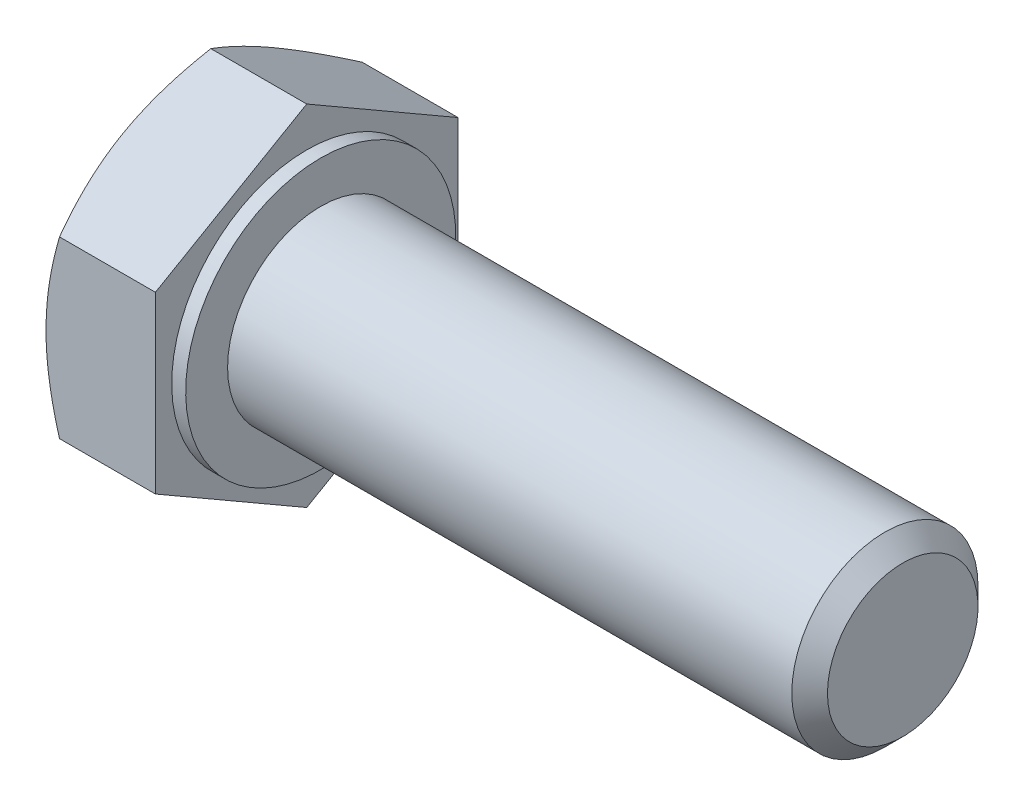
ISO-10303-21;
HEADER;
FILE_DESCRIPTION(('STEP AP214'),'2;1');
FILE_NAME('part.step','',(''),(''),'','','');
FILE_SCHEMA(('AUTOMOTIVE_DESIGN { 1 0 10303 214 1 1 1 1 }'));
ENDSEC;
DATA;
#1=APPLICATION_CONTEXT('core data for automotive mechanical design processes');
#2=APPLICATION_PROTOCOL_DEFINITION('international standard','automotive_design',2000,#1);
#3=PRODUCT_CONTEXT('',#1,'mechanical');
#4=PRODUCT('Part','Part','',(#3));
#5=PRODUCT_RELATED_PRODUCT_CATEGORY('part','',(#4));
#6=PRODUCT_DEFINITION_FORMATION('','',#4);
#7=PRODUCT_DEFINITION_CONTEXT('part definition',#1,'design');
#8=PRODUCT_DEFINITION('design','',#6,#7);
#9=PRODUCT_DEFINITION_SHAPE('','',#8);
#10=(LENGTH_UNIT() NAMED_UNIT(*) SI_UNIT(.MILLI.,.METRE.));
#11=(NAMED_UNIT(*) PLANE_ANGLE_UNIT() SI_UNIT($,.RADIAN.));
#12=(NAMED_UNIT(*) SI_UNIT($,.STERADIAN.) SOLID_ANGLE_UNIT());
#13=UNCERTAINTY_MEASURE_WITH_UNIT(LENGTH_MEASURE(1.E-05),#10,'distance_accuracy_value','');
#14=(GEOMETRIC_REPRESENTATION_CONTEXT(3) GLOBAL_UNCERTAINTY_ASSIGNED_CONTEXT((#13)) GLOBAL_UNIT_ASSIGNED_CONTEXT((#10,
#11,#12)) REPRESENTATION_CONTEXT('',''));
#15=CARTESIAN_POINT('',(0.,0.,0.));
#16=DIRECTION('',(0.,0.,1.));
#17=DIRECTION('',(1.,0.,0.));
#18=AXIS2_PLACEMENT_3D('',#15,#16,#17);
#19=CARTESIAN_POINT('',(-5.30009999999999,0.,0.));
#20=DIRECTION('',(1.,0.,0.));
#21=DIRECTION('',(0.,0.,-1.));
#22=AXIS2_PLACEMENT_3D('',#19,#20,#21);
#23=PLANE('',#22);
#24=CARTESIAN_POINT('',(-5.30010000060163,0.,0.));
#25=DIRECTION('',(1.,0.,0.));
#26=DIRECTION('',(0.,0.,-1.));
#27=AXIS2_PLACEMENT_3D('',#24,#25,#26);
#28=CIRCLE('',#27,6.50000000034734);
#29=CARTESIAN_POINT('',(-5.3001000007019,5.62916512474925,-3.25000000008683));
#30=VERTEX_POINT('',#29);
#31=CARTESIAN_POINT('',(-5.3001000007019,5.62916512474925,3.25000000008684));
#32=VERTEX_POINT('',#31);
#33=EDGE_CURVE('E322',#30,#32,#28,.T.);
#34=ORIENTED_EDGE('',*,*,#33,.F.);
#35=CARTESIAN_POINT('',(-5.30010000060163,0.,0.));
#36=DIRECTION('',(1.,0.,0.));
#37=DIRECTION('',(0.,0.,-1.));
#38=AXIS2_PLACEMENT_3D('',#35,#36,#37);
#39=CIRCLE('',#38,6.50000000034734);
#40=CARTESIAN_POINT('',(-5.3001000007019,0.,-6.50000000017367));
#41=VERTEX_POINT('',#40);
#42=EDGE_CURVE('E318',#41,#30,#39,.T.);
#43=ORIENTED_EDGE('',*,*,#42,.F.);
#44=CARTESIAN_POINT('',(-5.30010000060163,0.,0.));
#45=DIRECTION('',(1.,0.,0.));
#46=DIRECTION('',(0.,0.,-1.));
#47=AXIS2_PLACEMENT_3D('',#44,#45,#46);
#48=CIRCLE('',#47,6.50000000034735);
#49=CARTESIAN_POINT('',(-5.3001000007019,-5.62916512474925,-3.25000000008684));
#50=VERTEX_POINT('',#49);
#51=EDGE_CURVE('E314',#50,#41,#48,.T.);
#52=ORIENTED_EDGE('',*,*,#51,.F.);
#53=CARTESIAN_POINT('',(-5.30010000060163,0.,0.));
#54=DIRECTION('',(1.,0.,0.));
#55=DIRECTION('',(0.,0.,-1.));
#56=AXIS2_PLACEMENT_3D('',#53,#54,#55);
#57=CIRCLE('',#56,6.50000000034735);
#58=CARTESIAN_POINT('',(-5.3001000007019,-5.62916512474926,3.25000000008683));
#59=VERTEX_POINT('',#58);
#60=EDGE_CURVE('E89',#59,#50,#57,.T.);
#61=ORIENTED_EDGE('',*,*,#60,.F.);
#62=CARTESIAN_POINT('',(-5.30010000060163,0.,0.));
#63=DIRECTION('',(1.,0.,0.));
#64=DIRECTION('',(0.,0.,-1.));
#65=AXIS2_PLACEMENT_3D('',#62,#63,#64);
#66=CIRCLE('',#65,6.50000000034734);
#67=CARTESIAN_POINT('',(-5.3001000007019,0.,6.50000000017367));
#68=VERTEX_POINT('',#67);
#69=EDGE_CURVE('E86',#68,#59,#66,.T.);
#70=ORIENTED_EDGE('',*,*,#69,.F.);
#71=CARTESIAN_POINT('',(-5.30010000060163,0.,0.));
#72=DIRECTION('',(1.,0.,0.));
#73=DIRECTION('',(0.,0.,-1.));
#74=AXIS2_PLACEMENT_3D('',#71,#72,#73);
#75=CIRCLE('',#74,6.50000000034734);
#76=EDGE_CURVE('E18',#32,#68,#75,.T.);
#77=ORIENTED_EDGE('',*,*,#76,.F.);
#78=EDGE_LOOP('',(#34,#43,#52,#61,#70,#77));
#79=FACE_BOUND('',#78,.T.);
#80=ADVANCED_FACE('F15',(#79),#23,.F.);
#81=CARTESIAN_POINT('',(-4.71606007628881,0.,0.));
#82=DIRECTION('',(1.,0.,0.));
#83=DIRECTION('',(0.,0.,-1.));
#84=AXIS2_PLACEMENT_3D('',#81,#82,#83);
#85=CONICAL_SURFACE('',#84,7.51158682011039,1.04719755);
#86=ORIENTED_EDGE('',*,*,#76,.T.);
#87=CARTESIAN_POINT('',(-4.71954341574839,3.75277674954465,6.50000000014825));
#88=CARTESIAN_POINT('',(-4.80774841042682,3.44730232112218,6.50000000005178));
#89=CARTESIAN_POINT('',(-4.88855958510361,3.13938154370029,6.50000000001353));
#90=CARTESIAN_POINT('',(-5.03106863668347,2.52082569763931,6.49999999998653));
#91=CARTESIAN_POINT('',(-5.09286102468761,2.2102122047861,6.49999999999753));
#92=CARTESIAN_POINT('',(-5.16873158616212,1.74136052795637,6.50000000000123));
#93=CARTESIAN_POINT('',(-5.19122798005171,1.58448437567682,6.50000000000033));
#94=CARTESIAN_POINT('',(-5.23016970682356,1.26998104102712,6.49999999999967));
#95=CARTESIAN_POINT('',(-5.24661519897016,1.11235387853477,6.4999999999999));
#96=CARTESIAN_POINT('',(-5.27316617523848,0.795765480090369,6.50000000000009));
#97=CARTESIAN_POINT('',(-5.28323941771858,0.636801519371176,6.50000000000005));
#98=CARTESIAN_POINT('',(-5.29672027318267,0.31856096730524,6.49999999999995));
#99=CARTESIAN_POINT('',(-5.30012656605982,0.159284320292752,6.4999999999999));
#100=CARTESIAN_POINT('',(-5.30010000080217,1.44683826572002E-11,6.5));
#101=B_SPLINE_CURVE_WITH_KNOTS('',3,(#87,#88,#89,#90,#91,#92,#93,#94,#95,#96,#97,#98,#99,#100),
.UNSPECIFIED.,.F.,.F.,(4,2,2,2,2,2,4),(0.,0.95424765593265,1.90367376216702,2.37900973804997,
2.85433320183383,3.33204281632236,3.80984701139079),.UNSPECIFIED.);
#102=CARTESIAN_POINT('',(-4.71954341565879,3.75277674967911,6.49999999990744));
#103=VERTEX_POINT('',#102);
#104=EDGE_CURVE('E107',#103,#68,#101,.T.);
#105=ORIENTED_EDGE('',*,*,#104,.F.);
#106=CARTESIAN_POINT('',(-5.30010000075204,5.62916512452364,3.24999999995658));
#107=CARTESIAN_POINT('',(-5.30012656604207,5.54952296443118,3.38794426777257));
#108=CARTESIAN_POINT('',(-5.29672027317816,5.4698846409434,3.52588189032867));
#109=CARTESIAN_POINT('',(-5.28323941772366,5.31076436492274,3.80148629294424));
#110=CARTESIAN_POINT('',(-5.27316617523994,5.231282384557,3.93915312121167));
#111=CARTESIAN_POINT('',(-5.24661519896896,5.07298818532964,4.21332671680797));
#112=CARTESIAN_POINT('',(-5.23016970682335,4.99417460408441,4.34983584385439));
#113=CARTESIAN_POINT('',(-5.19122798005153,4.8369229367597,4.62220372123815));
#114=CARTESIAN_POINT('',(-5.16873158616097,4.75848486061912,4.75806245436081));
#115=CARTESIAN_POINT('',(-5.09286102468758,4.52405902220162,5.16409991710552));
#116=CARTESIAN_POINT('',(-5.03106863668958,4.36875227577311,5.43309909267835));
#117=CARTESIAN_POINT('',(-4.88855958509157,4.059474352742,5.96878416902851));
#118=CARTESIAN_POINT('',(-4.80774841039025,3.90551396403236,6.23545138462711));
#119=CARTESIAN_POINT('',(-4.71954341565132,3.7527767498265,6.49999999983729));
#120=B_SPLINE_CURVE_WITH_KNOTS('',3,(#106,#107,#108,#109,#110,#111,#112,#113,#114,#115,#116,
#117,#118,#119),.UNSPECIFIED.,.F.,.F.,(4,2,2,2,2,2,4),(0.,0.477804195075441,0.955513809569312,
1.43083727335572,1.90617324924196,2.85559935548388,3.80984701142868),.UNSPECIFIED.);
#121=EDGE_CURVE('E101',#32,#103,#120,.T.);
#122=ORIENTED_EDGE('',*,*,#121,.F.);
#123=EDGE_LOOP('',(#86,#105,#122));
#124=FACE_BOUND('',#123,.T.);
#125=ADVANCED_FACE('F106',(#124),#85,.T.);
#126=CARTESIAN_POINT('',(-4.71606007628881,0.,0.));
#127=DIRECTION('',(1.,0.,0.));
#128=DIRECTION('',(0.,0.,-1.));
#129=AXIS2_PLACEMENT_3D('',#126,#127,#128);
#130=CONICAL_SURFACE('',#129,7.51158682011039,1.04719755);
#131=CARTESIAN_POINT('',(-5.30010000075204,0.,6.49999999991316));
#132=CARTESIAN_POINT('',(-5.30012656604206,-0.159284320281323,6.49999999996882));
#133=CARTESIAN_POINT('',(-5.29672027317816,-0.318560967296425,6.49999999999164));
#134=CARTESIAN_POINT('',(-5.28323941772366,-0.636801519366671,6.50000000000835));
#135=CARTESIAN_POINT('',(-5.27316617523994,-0.795765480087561,6.50000000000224));
#136=CARTESIAN_POINT('',(-5.24661519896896,-1.11235387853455,6.49999999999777));
#137=CARTESIAN_POINT('',(-5.23016970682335,-1.26998104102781,6.49999999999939));
#138=CARTESIAN_POINT('',(-5.19122798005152,-1.58448437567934,6.50000000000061));
#139=CARTESIAN_POINT('',(-5.16873158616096,-1.74136052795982,6.50000000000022));
#140=CARTESIAN_POINT('',(-5.09286102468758,-2.21021220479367,6.49999999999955));
#141=CARTESIAN_POINT('',(-5.03106863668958,-2.52082569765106,6.49999999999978));
#142=CARTESIAN_POINT('',(-4.88855958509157,-3.13938154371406,6.50000000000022));
#143=CARTESIAN_POINT('',(-4.80774841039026,-3.44730232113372,6.50000000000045));
#144=CARTESIAN_POINT('',(-4.71954341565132,-3.75277674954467,6.5));
#145=B_SPLINE_CURVE_WITH_KNOTS('',3,(#131,#132,#133,#134,#135,#136,#137,#138,#139,#140,#141,
#142,#143,#144),.UNSPECIFIED.,.F.,.F.,(4,2,2,2,2,2,4),(0.,0.477804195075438,0.955513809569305,
1.43083727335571,1.90617324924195,2.85559935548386,3.80984701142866),.UNSPECIFIED.);
#146=CARTESIAN_POINT('',(-4.71954341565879,-3.75277674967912,6.49999999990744));
#147=VERTEX_POINT('',#146);
#148=EDGE_CURVE('E94',#68,#147,#145,.T.);
#149=ORIENTED_EDGE('',*,*,#148,.F.);
#150=ORIENTED_EDGE('',*,*,#69,.T.);
#151=CARTESIAN_POINT('',(-4.71954341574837,-3.75277674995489,6.49999999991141));
#152=CARTESIAN_POINT('',(-4.80774841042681,-3.90551396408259,6.23545138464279));
#153=CARTESIAN_POINT('',(-4.8885595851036,-4.05947435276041,5.96878416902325));
#154=CARTESIAN_POINT('',(-5.03106863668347,-4.36875227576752,5.43309909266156));
#155=CARTESIAN_POINT('',(-5.09286102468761,-4.52405902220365,5.16409991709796));
#156=CARTESIAN_POINT('',(-5.16873158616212,-4.75848486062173,4.75806245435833));
#157=CARTESIAN_POINT('',(-5.19122798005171,-4.83692293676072,4.62220372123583));
#158=CARTESIAN_POINT('',(-5.23016970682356,-4.99417460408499,4.34983584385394));
#159=CARTESIAN_POINT('',(-5.24661519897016,-5.07298818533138,4.21332671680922));
#160=CARTESIAN_POINT('',(-5.27316617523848,-5.23128238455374,3.93915312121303));
#161=CARTESIAN_POINT('',(-5.28323941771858,-5.3107643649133,3.80148629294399));
#162=CARTESIAN_POINT('',(-5.29672027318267,-5.46988464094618,3.52588189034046));
#163=CARTESIAN_POINT('',(-5.30012656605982,-5.54952296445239,3.38794426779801));
#164=CARTESIAN_POINT('',(-5.30010000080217,-5.62916512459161,3.25000000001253));
#165=B_SPLINE_CURVE_WITH_KNOTS('',3,(#151,#152,#153,#154,#155,#156,#157,#158,#159,#160,#161,
#162,#163,#164),.UNSPECIFIED.,.F.,.F.,(4,2,2,2,2,2,4),(0.,0.954247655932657,1.90367376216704,
2.37900973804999,2.85433320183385,3.33204281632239,3.80984701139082),.UNSPECIFIED.);
#166=EDGE_CURVE('E96',#147,#59,#165,.T.);
#167=ORIENTED_EDGE('',*,*,#166,.F.);
#168=EDGE_LOOP('',(#149,#150,#167));
#169=FACE_BOUND('',#168,.T.);
#170=ADVANCED_FACE('F95',(#169),#130,.T.);
#171=CARTESIAN_POINT('',(-4.71606007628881,0.,0.));
#172=DIRECTION('',(1.,0.,0.));
#173=DIRECTION('',(0.,0.,-1.));
#174=AXIS2_PLACEMENT_3D('',#171,#172,#173);
#175=CONICAL_SURFACE('',#174,7.51158682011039,1.04719755);
#176=CARTESIAN_POINT('',(-5.30010000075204,-5.62916512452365,3.24999999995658));
#177=CARTESIAN_POINT('',(-5.30012656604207,-5.7088072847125,3.11205573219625));
#178=CARTESIAN_POINT('',(-5.29672027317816,-5.78844560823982,2.97411810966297));
#179=CARTESIAN_POINT('',(-5.28323941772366,-5.94756588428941,2.69851370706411));
#180=CARTESIAN_POINT('',(-5.27316617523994,-6.02704786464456,2.56084687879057));
#181=CARTESIAN_POINT('',(-5.24661519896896,-6.18534206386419,2.28667328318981));
#182=CARTESIAN_POINT('',(-5.23016970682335,-6.26415564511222,2.150164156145));
#183=CARTESIAN_POINT('',(-5.19122798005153,-6.42140731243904,1.87779627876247));
#184=CARTESIAN_POINT('',(-5.16873158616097,-6.49984538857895,1.74193754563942));
#185=CARTESIAN_POINT('',(-5.09286102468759,-6.7342712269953,1.33590008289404));
#186=CARTESIAN_POINT('',(-5.03106863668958,-6.88957797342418,1.06690090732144));
#187=CARTESIAN_POINT('',(-4.88855958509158,-7.19885589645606,0.531215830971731));
#188=CARTESIAN_POINT('',(-4.80774841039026,-7.35281628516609,0.264548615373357));
#189=CARTESIAN_POINT('',(-4.71954341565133,-7.50555349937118,1.6272616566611E-10));
#190=B_SPLINE_CURVE_WITH_KNOTS('',3,(#176,#177,#178,#179,#180,#181,#182,#183,#184,#185,#186,
#187,#188,#189),.UNSPECIFIED.,.F.,.F.,(4,2,2,2,2,2,4),(0.,0.477804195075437,0.955513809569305,
1.43083727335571,1.90617324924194,2.85559935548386,3.80984701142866),.UNSPECIFIED.);
#191=CARTESIAN_POINT('',(-4.71954341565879,-7.50555349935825,0.));
#192=VERTEX_POINT('',#191);
#193=EDGE_CURVE('E112',#59,#192,#190,.T.);
#194=ORIENTED_EDGE('',*,*,#193,.F.);
#195=ORIENTED_EDGE('',*,*,#60,.T.);
#196=CARTESIAN_POINT('',(-4.71954341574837,-7.50555349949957,-2.36832132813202E-10));
#197=CARTESIAN_POINT('',(-4.80774841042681,-7.3528162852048,-0.264548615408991));
#198=CARTESIAN_POINT('',(-4.8885595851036,-7.19885589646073,-0.531215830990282));
#199=CARTESIAN_POINT('',(-5.03106863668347,-6.88957797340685,-1.06690090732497));
#200=CARTESIAN_POINT('',(-5.09286102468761,-6.73427122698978,-1.33590008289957));
#201=CARTESIAN_POINT('',(-5.16873158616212,-6.49984538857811,-1.7419375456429));
#202=CARTESIAN_POINT('',(-5.19122798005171,-6.42140731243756,-1.8777962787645));
#203=CARTESIAN_POINT('',(-5.23016970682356,-6.26415564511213,-2.15016415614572));
#204=CARTESIAN_POINT('',(-5.24661519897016,-6.18534206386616,-2.28667328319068));
#205=CARTESIAN_POINT('',(-5.27316617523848,-6.02704786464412,-2.56084687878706));
#206=CARTESIAN_POINT('',(-5.28323941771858,-5.94756588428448,-2.69851370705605));
#207=CARTESIAN_POINT('',(-5.29672027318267,-5.78844560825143,-2.97411810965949));
#208=CARTESIAN_POINT('',(-5.30012656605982,-5.70880728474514,-3.11205573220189));
#209=CARTESIAN_POINT('',(-5.30010000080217,-5.62916512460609,-3.24999999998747));
#210=B_SPLINE_CURVE_WITH_KNOTS('',3,(#196,#197,#198,#199,#200,#201,#202,#203,#204,#205,#206,
#207,#208,#209),.UNSPECIFIED.,.F.,.F.,(4,2,2,2,2,2,4),(0.,0.954247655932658,1.90367376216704,
2.37900973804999,2.85433320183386,3.33204281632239,3.80984701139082),.UNSPECIFIED.);
#211=EDGE_CURVE('E206',#192,#50,#210,.T.);
#212=ORIENTED_EDGE('',*,*,#211,.F.);
#213=EDGE_LOOP('',(#194,#195,#212));
#214=FACE_BOUND('',#213,.T.);
#215=ADVANCED_FACE('F214',(#214),#175,.T.);
#216=CARTESIAN_POINT('',(-4.71606007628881,0.,0.));
#217=DIRECTION('',(1.,0.,0.));
#218=DIRECTION('',(0.,0.,-1.));
#219=AXIS2_PLACEMENT_3D('',#216,#217,#218);
#220=CONICAL_SURFACE('',#219,7.51158682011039,1.04719755);
#221=CARTESIAN_POINT('',(-5.30010000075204,-5.62916512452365,-3.24999999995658));
#222=CARTESIAN_POINT('',(-5.30012656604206,-5.54952296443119,-3.38794426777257));
#223=CARTESIAN_POINT('',(-5.29672027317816,-5.46988464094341,-3.52588189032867));
#224=CARTESIAN_POINT('',(-5.28323941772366,-5.31076436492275,-3.80148629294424));
#225=CARTESIAN_POINT('',(-5.27316617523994,-5.23128238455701,-3.93915312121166));
#226=CARTESIAN_POINT('',(-5.24661519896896,-5.07298818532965,-4.21332671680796));
#227=CARTESIAN_POINT('',(-5.23016970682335,-4.99417460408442,-4.34983584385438));
#228=CARTESIAN_POINT('',(-5.19122798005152,-4.83692293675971,-4.62220372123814));
#229=CARTESIAN_POINT('',(-5.16873158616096,-4.75848486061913,-4.7580624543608));
#230=CARTESIAN_POINT('',(-5.09286102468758,-4.52405902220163,-5.16409991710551));
#231=CARTESIAN_POINT('',(-5.03106863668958,-4.36875227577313,-5.43309909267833));
#232=CARTESIAN_POINT('',(-4.88855958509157,-4.05947435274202,-5.96878416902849));
#233=CARTESIAN_POINT('',(-4.80774841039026,-3.90551396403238,-6.23545138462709));
#234=CARTESIAN_POINT('',(-4.71954341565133,-3.75277674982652,-6.49999999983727));
#235=B_SPLINE_CURVE_WITH_KNOTS('',3,(#221,#222,#223,#224,#225,#226,#227,#228,#229,#230,#231,
#232,#233,#234),.UNSPECIFIED.,.F.,.F.,(4,2,2,2,2,2,4),(0.,0.477804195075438,0.955513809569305,
1.43083727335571,1.90617324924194,2.85559935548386,3.80984701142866),.UNSPECIFIED.);
#236=CARTESIAN_POINT('',(-4.71954341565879,-3.75277674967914,-6.49999999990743));
#237=VERTEX_POINT('',#236);
#238=EDGE_CURVE('E218',#50,#237,#235,.T.);
#239=ORIENTED_EDGE('',*,*,#238,.F.);
#240=ORIENTED_EDGE('',*,*,#51,.T.);
#241=CARTESIAN_POINT('',(-4.71954341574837,-3.75277674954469,-6.50000000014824));
#242=CARTESIAN_POINT('',(-4.8077484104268,-3.44730232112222,-6.50000000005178));
#243=CARTESIAN_POINT('',(-4.8885595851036,-3.13938154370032,-6.50000000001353));
#244=CARTESIAN_POINT('',(-5.03106863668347,-2.52082569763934,-6.49999999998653));
#245=CARTESIAN_POINT('',(-5.09286102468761,-2.21021220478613,-6.49999999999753));
#246=CARTESIAN_POINT('',(-5.16873158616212,-1.74136052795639,-6.50000000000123));
#247=CARTESIAN_POINT('',(-5.19122798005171,-1.58448437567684,-6.50000000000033));
#248=CARTESIAN_POINT('',(-5.23016970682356,-1.26998104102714,-6.49999999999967));
#249=CARTESIAN_POINT('',(-5.24661519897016,-1.11235387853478,-6.4999999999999));
#250=CARTESIAN_POINT('',(-5.27316617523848,-0.795765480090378,-6.50000000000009));
#251=CARTESIAN_POINT('',(-5.28323941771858,-0.636801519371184,-6.50000000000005));
#252=CARTESIAN_POINT('',(-5.29672027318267,-0.318560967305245,-6.49999999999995));
#253=CARTESIAN_POINT('',(-5.30012656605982,-0.159284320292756,-6.4999999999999));
#254=CARTESIAN_POINT('',(-5.30010000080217,-1.4470694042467E-11,-6.5));
#255=B_SPLINE_CURVE_WITH_KNOTS('',3,(#241,#242,#243,#244,#245,#246,#247,#248,#249,#250,#251,
#252,#253,#254),.UNSPECIFIED.,.F.,.F.,(4,2,2,2,2,2,4),(0.,0.954247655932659,1.90367376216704,
2.37900973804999,2.85433320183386,3.3320428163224,3.80984701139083),.UNSPECIFIED.);
#256=EDGE_CURVE('E200',#237,#41,#255,.T.);
#257=ORIENTED_EDGE('',*,*,#256,.F.);
#258=EDGE_LOOP('',(#239,#240,#257));
#259=FACE_BOUND('',#258,.T.);
#260=ADVANCED_FACE('F211',(#259),#220,.T.);
#261=CARTESIAN_POINT('',(-4.71606007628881,0.,0.));
#262=DIRECTION('',(1.,0.,0.));
#263=DIRECTION('',(0.,0.,-1.));
#264=AXIS2_PLACEMENT_3D('',#261,#262,#263);
#265=CONICAL_SURFACE('',#264,7.51158682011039,1.04719755);
#266=ORIENTED_EDGE('',*,*,#42,.T.);
#267=CARTESIAN_POINT('',(-4.71954341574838,3.75277674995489,-6.49999999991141));
#268=CARTESIAN_POINT('',(-4.80774841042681,3.90551396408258,-6.23545138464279));
#269=CARTESIAN_POINT('',(-4.8885595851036,4.05947435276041,-5.96878416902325));
#270=CARTESIAN_POINT('',(-5.03106863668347,4.36875227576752,-5.43309909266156));
#271=CARTESIAN_POINT('',(-5.09286102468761,4.52405902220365,-5.16409991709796));
#272=CARTESIAN_POINT('',(-5.16873158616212,4.75848486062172,-4.75806245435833));
#273=CARTESIAN_POINT('',(-5.19122798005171,4.83692293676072,-4.62220372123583));
#274=CARTESIAN_POINT('',(-5.23016970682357,4.99417460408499,-4.34983584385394));
#275=CARTESIAN_POINT('',(-5.24661519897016,5.07298818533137,-4.21332671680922));
#276=CARTESIAN_POINT('',(-5.27316617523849,5.23128238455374,-3.93915312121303));
#277=CARTESIAN_POINT('',(-5.28323941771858,5.3107643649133,-3.80148629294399));
#278=CARTESIAN_POINT('',(-5.29672027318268,5.46988464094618,-3.52588189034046));
#279=CARTESIAN_POINT('',(-5.30012656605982,5.54952296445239,-3.38794426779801));
#280=CARTESIAN_POINT('',(-5.30010000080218,5.62916512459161,-3.25000000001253));
#281=B_SPLINE_CURVE_WITH_KNOTS('',3,(#267,#268,#269,#270,#271,#272,#273,#274,#275,#276,#277,
#278,#279,#280),.UNSPECIFIED.,.F.,.F.,(4,2,2,2,2,2,4),(0.,0.954247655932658,1.90367376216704,
2.37900973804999,2.85433320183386,3.3320428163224,3.80984701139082),.UNSPECIFIED.);
#282=CARTESIAN_POINT('',(-4.71954341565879,3.75277674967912,-6.49999999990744));
#283=VERTEX_POINT('',#282);
#284=EDGE_CURVE('E172',#283,#30,#281,.T.);
#285=ORIENTED_EDGE('',*,*,#284,.F.);
#286=CARTESIAN_POINT('',(-5.30010000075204,0.,-6.49999999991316));
#287=CARTESIAN_POINT('',(-5.30012656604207,0.15928432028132,-6.49999999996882));
#288=CARTESIAN_POINT('',(-5.29672027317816,0.318560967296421,-6.49999999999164));
#289=CARTESIAN_POINT('',(-5.28323941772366,0.636801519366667,-6.50000000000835));
#290=CARTESIAN_POINT('',(-5.27316617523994,0.795765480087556,-6.50000000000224));
#291=CARTESIAN_POINT('',(-5.24661519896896,1.11235387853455,-6.49999999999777));
#292=CARTESIAN_POINT('',(-5.23016970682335,1.26998104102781,-6.49999999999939));
#293=CARTESIAN_POINT('',(-5.19122798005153,1.58448437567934,-6.50000000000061));
#294=CARTESIAN_POINT('',(-5.16873158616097,1.74136052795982,-6.50000000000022));
#295=CARTESIAN_POINT('',(-5.09286102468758,2.21021220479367,-6.49999999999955));
#296=CARTESIAN_POINT('',(-5.03106863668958,2.52082569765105,-6.49999999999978));
#297=CARTESIAN_POINT('',(-4.88855958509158,3.13938154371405,-6.50000000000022));
#298=CARTESIAN_POINT('',(-4.80774841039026,3.44730232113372,-6.50000000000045));
#299=CARTESIAN_POINT('',(-4.71954341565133,3.75277674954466,-6.5));
#300=B_SPLINE_CURVE_WITH_KNOTS('',3,(#286,#287,#288,#289,#290,#291,#292,#293,#294,#295,#296,
#297,#298,#299),.UNSPECIFIED.,.F.,.F.,(4,2,2,2,2,2,4),(0.,0.477804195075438,0.955513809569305,
1.43083727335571,1.90617324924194,2.85559935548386,3.80984701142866),.UNSPECIFIED.);
#301=EDGE_CURVE('E195',#41,#283,#300,.T.);
#302=ORIENTED_EDGE('',*,*,#301,.F.);
#303=EDGE_LOOP('',(#266,#285,#302));
#304=FACE_BOUND('',#303,.T.);
#305=ADVANCED_FACE('F157',(#304),#265,.T.);
#306=CARTESIAN_POINT('',(-4.71606007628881,0.,0.));
#307=DIRECTION('',(1.,0.,0.));
#308=DIRECTION('',(0.,0.,-1.));
#309=AXIS2_PLACEMENT_3D('',#306,#307,#308);
#310=CONICAL_SURFACE('',#309,7.51158682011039,1.04719755);
#311=ORIENTED_EDGE('',*,*,#33,.T.);
#312=CARTESIAN_POINT('',(-4.71954341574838,7.50555349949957,2.36845423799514E-10));
#313=CARTESIAN_POINT('',(-4.80774841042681,7.3528162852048,0.264548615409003));
#314=CARTESIAN_POINT('',(-4.8885595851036,7.19885589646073,0.531215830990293));
#315=CARTESIAN_POINT('',(-5.03106863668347,6.88957797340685,1.06690090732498));
#316=CARTESIAN_POINT('',(-5.09286102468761,6.73427122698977,1.33590008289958));
#317=CARTESIAN_POINT('',(-5.16873158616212,6.49984538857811,1.74193754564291));
#318=CARTESIAN_POINT('',(-5.19122798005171,6.42140731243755,1.8777962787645));
#319=CARTESIAN_POINT('',(-5.23016970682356,6.26415564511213,2.15016415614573));
#320=CARTESIAN_POINT('',(-5.24661519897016,6.18534206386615,2.28667328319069));
#321=CARTESIAN_POINT('',(-5.27316617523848,6.02704786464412,2.56084687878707));
#322=CARTESIAN_POINT('',(-5.28323941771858,5.94756588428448,2.69851370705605));
#323=CARTESIAN_POINT('',(-5.29672027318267,5.78844560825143,2.97411810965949));
#324=CARTESIAN_POINT('',(-5.30012656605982,5.70880728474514,3.11205573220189));
#325=CARTESIAN_POINT('',(-5.30010000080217,5.62916512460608,3.24999999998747));
#326=B_SPLINE_CURVE_WITH_KNOTS('',3,(#312,#313,#314,#315,#316,#317,#318,#319,#320,#321,#322,
#323,#324,#325),.UNSPECIFIED.,.F.,.F.,(4,2,2,2,2,2,4),(0.,0.954247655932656,1.90367376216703,
2.37900973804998,2.85433320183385,3.33204281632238,3.80984701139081),.UNSPECIFIED.);
#327=CARTESIAN_POINT('',(-4.71954341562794,7.50555349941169,9.25589075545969E-11));
#328=VERTEX_POINT('',#327);
#329=EDGE_CURVE('E142',#328,#32,#326,.T.);
#330=ORIENTED_EDGE('',*,*,#329,.F.);
#331=CARTESIAN_POINT('',(-5.30010000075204,5.62916512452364,-3.24999999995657));
#332=CARTESIAN_POINT('',(-5.30012656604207,5.7088072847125,-3.11205573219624));
#333=CARTESIAN_POINT('',(-5.29672027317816,5.78844560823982,-2.97411810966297));
#334=CARTESIAN_POINT('',(-5.28323941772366,5.94756588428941,-2.69851370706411));
#335=CARTESIAN_POINT('',(-5.27316617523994,6.02704786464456,-2.56084687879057));
#336=CARTESIAN_POINT('',(-5.24661519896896,6.1853420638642,-2.28667328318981));
#337=CARTESIAN_POINT('',(-5.23016970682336,6.26415564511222,-2.150164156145));
#338=CARTESIAN_POINT('',(-5.19122798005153,6.42140731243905,-1.87779627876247));
#339=CARTESIAN_POINT('',(-5.16873158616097,6.49984538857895,-1.74193754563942));
#340=CARTESIAN_POINT('',(-5.09286102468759,6.7342712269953,-1.33590008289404));
#341=CARTESIAN_POINT('',(-5.03106863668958,6.88957797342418,-1.06690090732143));
#342=CARTESIAN_POINT('',(-4.88855958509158,7.19885589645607,-0.531215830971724));
#343=CARTESIAN_POINT('',(-4.80774841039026,7.3528162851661,-0.264548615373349));
#344=CARTESIAN_POINT('',(-4.71954341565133,7.50555349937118,-1.62717065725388E-10));
#345=B_SPLINE_CURVE_WITH_KNOTS('',3,(#331,#332,#333,#334,#335,#336,#337,#338,#339,#340,#341,
#342,#343,#344),.UNSPECIFIED.,.F.,.F.,(4,2,2,2,2,2,4),(0.,0.477804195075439,0.955513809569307,
1.43083727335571,1.90617324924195,2.85559935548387,3.80984701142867),.UNSPECIFIED.);
#346=EDGE_CURVE('E163',#30,#328,#345,.T.);
#347=ORIENTED_EDGE('',*,*,#346,.F.);
#348=EDGE_LOOP('',(#311,#330,#347));
#349=FACE_BOUND('',#348,.T.);
#350=ADVANCED_FACE('F151',(#349),#310,.T.);
#351=CARTESIAN_POINT('',(-0.600099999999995,7.50555349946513,0.));
#352=DIRECTION('',(0.,0.866025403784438,0.500000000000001));
#353=DIRECTION('',(0.,-0.500000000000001,0.866025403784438));
#354=AXIS2_PLACEMENT_3D('',#351,#352,#353);
#355=PLANE('',#354);
#356=DIRECTION('',(0.,-0.500000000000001,0.866025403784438));
#357=VECTOR('',#356,1.);
#358=CARTESIAN_POINT('',(-0.600099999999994,7.50555349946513,0.));
#359=LINE('',#358,#357);
#360=CARTESIAN_POINT('',(-0.600099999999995,7.50555349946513,0.));
#361=VERTEX_POINT('',#360);
#362=CARTESIAN_POINT('',(-0.600099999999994,3.75277674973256,6.5));
#363=VERTEX_POINT('',#362);
#364=EDGE_CURVE('E283',#361,#363,#359,.T.);
#365=ORIENTED_EDGE('',*,*,#364,.F.);
#366=DIRECTION('',(1.,0.,0.));
#367=VECTOR('',#366,1.);
#368=CARTESIAN_POINT('',(-0.600099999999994,7.50555349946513,0.));
#369=LINE('',#368,#367);
#370=EDGE_CURVE('E171',#328,#361,#369,.T.);
#371=ORIENTED_EDGE('',*,*,#370,.F.);
#372=ORIENTED_EDGE('',*,*,#329,.T.);
#373=ORIENTED_EDGE('',*,*,#121,.T.);
#374=DIRECTION('',(1.,0.,0.));
#375=VECTOR('',#374,1.);
#376=CARTESIAN_POINT('',(-0.600099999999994,3.75277674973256,6.5));
#377=LINE('',#376,#375);
#378=EDGE_CURVE('E100',#363,#103,#377,.F.);
#379=ORIENTED_EDGE('',*,*,#378,.F.);
#380=EDGE_LOOP('',(#365,#371,#372,#373,#379));
#381=FACE_BOUND('',#380,.T.);
#382=ADVANCED_FACE('F148',(#381),#355,.T.);
#383=CARTESIAN_POINT('',(-0.600099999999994,3.75277674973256,6.5));
#384=DIRECTION('',(0.,0.,1.));
#385=DIRECTION('',(1.,0.,0.));
#386=AXIS2_PLACEMENT_3D('',#383,#384,#385);
#387=PLANE('',#386);
#388=ORIENTED_EDGE('',*,*,#378,.T.);
#389=ORIENTED_EDGE('',*,*,#104,.T.);
#390=ORIENTED_EDGE('',*,*,#148,.T.);
#391=DIRECTION('',(1.,0.,0.));
#392=VECTOR('',#391,1.);
#393=CARTESIAN_POINT('',(-0.600099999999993,-3.75277674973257,6.49999999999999));
#394=LINE('',#393,#392);
#395=CARTESIAN_POINT('',(-0.600099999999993,-3.75277674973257,6.5));
#396=VERTEX_POINT('',#395);
#397=EDGE_CURVE('E114',#396,#147,#394,.F.);
#398=ORIENTED_EDGE('',*,*,#397,.F.);
#399=DIRECTION('',(0.,1.,0.));
#400=VECTOR('',#399,1.);
#401=CARTESIAN_POINT('',(-0.600099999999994,0.,6.5));
#402=LINE('',#401,#400);
#403=EDGE_CURVE('E279',#363,#396,#402,.F.);
#404=ORIENTED_EDGE('',*,*,#403,.F.);
#405=EDGE_LOOP('',(#388,#389,#390,#398,#404));
#406=FACE_BOUND('',#405,.T.);
#407=ADVANCED_FACE('F110',(#406),#387,.T.);
#408=CARTESIAN_POINT('',(-0.600099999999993,-3.75277674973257,6.49999999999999));
#409=DIRECTION('',(0.,-0.866025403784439,0.499999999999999));
#410=DIRECTION('',(0.,-0.499999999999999,-0.866025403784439));
#411=AXIS2_PLACEMENT_3D('',#408,#409,#410);
#412=PLANE('',#411);
#413=ORIENTED_EDGE('',*,*,#397,.T.);
#414=ORIENTED_EDGE('',*,*,#166,.T.);
#415=ORIENTED_EDGE('',*,*,#193,.T.);
#416=DIRECTION('',(1.,0.,0.));
#417=VECTOR('',#416,1.);
#418=CARTESIAN_POINT('',(-0.600099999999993,-7.50555349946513,0.));
#419=LINE('',#418,#417);
#420=CARTESIAN_POINT('',(-0.600099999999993,-7.50555349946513,0.));
#421=VERTEX_POINT('',#420);
#422=EDGE_CURVE('E223',#421,#192,#419,.F.);
#423=ORIENTED_EDGE('',*,*,#422,.F.);
#424=DIRECTION('',(0.,-0.499999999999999,-0.866025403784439));
#425=VECTOR('',#424,1.);
#426=CARTESIAN_POINT('',(-0.600099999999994,-3.75277674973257,6.49999999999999));
#427=LINE('',#426,#425);
#428=EDGE_CURVE('E282',#396,#421,#427,.T.);
#429=ORIENTED_EDGE('',*,*,#428,.F.);
#430=EDGE_LOOP('',(#413,#414,#415,#423,#429));
#431=FACE_BOUND('',#430,.T.);
#432=ADVANCED_FACE('F227',(#431),#412,.T.);
#433=CARTESIAN_POINT('',(-0.600099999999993,-7.50555349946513,0.));
#434=DIRECTION('',(0.,-0.866025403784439,-0.5));
#435=DIRECTION('',(0.,0.5,-0.866025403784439));
#436=AXIS2_PLACEMENT_3D('',#433,#434,#435);
#437=PLANE('',#436);
#438=ORIENTED_EDGE('',*,*,#422,.T.);
#439=ORIENTED_EDGE('',*,*,#211,.T.);
#440=ORIENTED_EDGE('',*,*,#238,.T.);
#441=DIRECTION('',(-1.,0.,0.));
#442=VECTOR('',#441,1.);
#443=CARTESIAN_POINT('',(-0.600099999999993,-3.75277674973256,-6.5));
#444=LINE('',#443,#442);
#445=CARTESIAN_POINT('',(-0.600099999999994,-3.75277674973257,-6.5));
#446=VERTEX_POINT('',#445);
#447=EDGE_CURVE('E299',#446,#237,#444,.T.);
#448=ORIENTED_EDGE('',*,*,#447,.F.);
#449=DIRECTION('',(0.,0.5,-0.866025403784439));
#450=VECTOR('',#449,1.);
#451=CARTESIAN_POINT('',(-0.600099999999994,-7.50555349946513,0.));
#452=LINE('',#451,#450);
#453=EDGE_CURVE('E286',#421,#446,#452,.T.);
#454=ORIENTED_EDGE('',*,*,#453,.F.);
#455=EDGE_LOOP('',(#438,#439,#440,#448,#454));
#456=FACE_BOUND('',#455,.T.);
#457=ADVANCED_FACE('F192',(#456),#437,.T.);
#458=CARTESIAN_POINT('',(-0.600099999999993,-3.75277674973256,-6.5));
#459=DIRECTION('',(0.,0.,-1.));
#460=DIRECTION('',(-1.,0.,0.));
#461=AXIS2_PLACEMENT_3D('',#458,#459,#460);
#462=PLANE('',#461);
#463=DIRECTION('',(0.,1.,0.));
#464=VECTOR('',#463,1.);
#465=CARTESIAN_POINT('',(-0.600099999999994,0.,-6.5));
#466=LINE('',#465,#464);
#467=CARTESIAN_POINT('',(-0.600099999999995,3.75277674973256,-6.49999999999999));
#468=VERTEX_POINT('',#467);
#469=EDGE_CURVE('E289',#446,#468,#466,.T.);
#470=ORIENTED_EDGE('',*,*,#469,.F.);
#471=ORIENTED_EDGE('',*,*,#447,.T.);
#472=ORIENTED_EDGE('',*,*,#256,.T.);
#473=ORIENTED_EDGE('',*,*,#301,.T.);
#474=DIRECTION('',(1.,0.,0.));
#475=VECTOR('',#474,1.);
#476=CARTESIAN_POINT('',(-0.600099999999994,3.75277674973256,-6.49999999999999));
#477=LINE('',#476,#475);
#478=EDGE_CURVE('E33',#468,#283,#477,.F.);
#479=ORIENTED_EDGE('',*,*,#478,.F.);
#480=EDGE_LOOP('',(#470,#471,#472,#473,#479));
#481=FACE_BOUND('',#480,.T.);
#482=ADVANCED_FACE('F185',(#481),#462,.T.);
#483=CARTESIAN_POINT('',(-0.600099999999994,3.75277674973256,-6.49999999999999));
#484=DIRECTION('',(0.,0.866025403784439,-0.5));
#485=DIRECTION('',(0.,0.5,0.866025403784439));
#486=AXIS2_PLACEMENT_3D('',#483,#484,#485);
#487=PLANE('',#486);
#488=DIRECTION('',(0.,0.5,0.866025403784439));
#489=VECTOR('',#488,1.);
#490=CARTESIAN_POINT('',(-0.600099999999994,3.75277674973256,-6.49999999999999));
#491=LINE('',#490,#489);
#492=EDGE_CURVE('E275',#468,#361,#491,.T.);
#493=ORIENTED_EDGE('',*,*,#492,.F.);
#494=ORIENTED_EDGE('',*,*,#478,.T.);
#495=ORIENTED_EDGE('',*,*,#284,.T.);
#496=ORIENTED_EDGE('',*,*,#346,.T.);
#497=ORIENTED_EDGE('',*,*,#370,.T.);
#498=EDGE_LOOP('',(#493,#494,#495,#496,#497));
#499=FACE_BOUND('',#498,.T.);
#500=ADVANCED_FACE('F179',(#499),#487,.T.);
#501=CARTESIAN_POINT('',(-0.600099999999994,0.,0.));
#502=DIRECTION('',(1.,0.,0.));
#503=DIRECTION('',(0.,0.,-1.));
#504=AXIS2_PLACEMENT_3D('',#501,#502,#503);
#505=PLANE('',#504);
#506=CARTESIAN_POINT('',(-0.600099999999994,0.,0.));
#507=DIRECTION('',(1.,0.,0.));
#508=DIRECTION('',(0.,1.,0.));
#509=AXIS2_PLACEMENT_3D('',#506,#507,#508);
#510=CIRCLE('',#509,5.8);
#511=CARTESIAN_POINT('',(-0.600099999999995,5.8,0.));
#512=VERTEX_POINT('',#511);
#513=EDGE_CURVE('E173',#512,#512,#510,.T.);
#514=ORIENTED_EDGE('',*,*,#513,.F.);
#515=EDGE_LOOP('',(#514));
#516=FACE_BOUND('',#515,.T.);
#517=ORIENTED_EDGE('',*,*,#469,.T.);
#518=ORIENTED_EDGE('',*,*,#492,.T.);
#519=ORIENTED_EDGE('',*,*,#364,.T.);
#520=ORIENTED_EDGE('',*,*,#403,.T.);
#521=ORIENTED_EDGE('',*,*,#428,.T.);
#522=ORIENTED_EDGE('',*,*,#453,.T.);
#523=EDGE_LOOP('',(#517,#518,#519,#520,#521,#522));
#524=FACE_BOUND('',#523,.T.);
#525=ADVANCED_FACE('F184',(#516,#524),#505,.T.);
#526=CARTESIAN_POINT('',(-0.300049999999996,0.,0.));
#527=DIRECTION('',(1.,0.,0.));
#528=DIRECTION('',(0.,1.,0.));
#529=AXIS2_PLACEMENT_3D('',#526,#527,#528);
#530=CYLINDRICAL_SURFACE('',#529,5.8);
#531=ORIENTED_EDGE('',*,*,#513,.T.);
#532=EDGE_LOOP('',(#531));
#533=FACE_BOUND('',#532,.T.);
#534=CARTESIAN_POINT('',(0.,0.,0.));
#535=DIRECTION('',(1.,0.,0.));
#536=DIRECTION('',(0.,1.,0.));
#537=AXIS2_PLACEMENT_3D('',#534,#535,#536);
#538=CIRCLE('',#537,5.8);
#539=CARTESIAN_POINT('',(0.,5.8,0.));
#540=VERTEX_POINT('',#539);
#541=EDGE_CURVE('E270',#540,#540,#538,.T.);
#542=ORIENTED_EDGE('',*,*,#541,.F.);
#543=EDGE_LOOP('',(#542));
#544=FACE_BOUND('',#543,.T.);
#545=ADVANCED_FACE('F257',(#533,#544),#530,.T.);
#546=CARTESIAN_POINT('',(25.,2.,0.));
#547=DIRECTION('',(1.,0.,0.));
#548=DIRECTION('',(0.,0.,-1.));
#549=AXIS2_PLACEMENT_3D('',#546,#547,#548);
#550=PLANE('',#549);
#551=CARTESIAN_POINT('',(25.0000000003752,0.,0.));
#552=DIRECTION('',(-1.,0.,0.));
#553=DIRECTION('',(0.,0.,1.));
#554=AXIS2_PLACEMENT_3D('',#551,#552,#553);
#555=CIRCLE('',#554,3.23318750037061);
#556=CARTESIAN_POINT('',(25.0000000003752,0.,3.23318750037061));
#557=VERTEX_POINT('',#556);
#558=EDGE_CURVE('E272',#557,#557,#555,.T.);
#559=ORIENTED_EDGE('',*,*,#558,.F.);
#560=EDGE_LOOP('',(#559));
#561=FACE_BOUND('',#560,.T.);
#562=ADVANCED_FACE('F254',(#561),#550,.T.);
#563=CARTESIAN_POINT('',(0.,4.9,0.));
#564=DIRECTION('',(1.,0.,0.));
#565=DIRECTION('',(0.,0.,-1.));
#566=AXIS2_PLACEMENT_3D('',#563,#564,#565);
#567=PLANE('',#566);
#568=CARTESIAN_POINT('',(0.,0.,0.));
#569=DIRECTION('',(1.,0.,0.));
#570=DIRECTION('',(0.,1.,0.));
#571=AXIS2_PLACEMENT_3D('',#568,#569,#570);
#572=CIRCLE('',#571,4.);
#573=CARTESIAN_POINT('',(0.,4.,0.));
#574=VERTEX_POINT('',#573);
#575=EDGE_CURVE('E24',#574,#574,#572,.T.);
#576=ORIENTED_EDGE('',*,*,#575,.F.);
#577=EDGE_LOOP('',(#576));
#578=FACE_BOUND('',#577,.T.);
#579=ORIENTED_EDGE('',*,*,#541,.T.);
#580=EDGE_LOOP('',(#579));
#581=FACE_BOUND('',#580,.T.);
#582=ADVANCED_FACE('F247',(#578,#581),#567,.T.);
#583=CARTESIAN_POINT('',(24.2330874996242,0.,0.));
#584=DIRECTION('',(-1.,0.,0.));
#585=DIRECTION('',(0.,0.,1.));
#586=AXIS2_PLACEMENT_3D('',#583,#584,#585);
#587=CONICAL_SURFACE('',#586,3.99999999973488,0.785332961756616);
#588=ORIENTED_EDGE('',*,*,#558,.T.);
#589=EDGE_LOOP('',(#588));
#590=FACE_BOUND('',#589,.T.);
#591=CARTESIAN_POINT('',(24.2330875,0.,0.));
#592=DIRECTION('',(1.,0.,0.));
#593=DIRECTION('',(0.,1.,0.));
#594=AXIS2_PLACEMENT_3D('',#591,#592,#593);
#595=CIRCLE('',#594,4.);
#596=CARTESIAN_POINT('',(24.2330875,4.,0.));
#597=VERTEX_POINT('',#596);
#598=EDGE_CURVE('E10',#597,#597,#595,.F.);
#599=ORIENTED_EDGE('',*,*,#598,.F.);
#600=EDGE_LOOP('',(#599));
#601=FACE_BOUND('',#600,.T.);
#602=ADVANCED_FACE('F240',(#590,#601),#587,.T.);
#603=CARTESIAN_POINT('',(13.,0.,0.));
#604=DIRECTION('',(1.,0.,0.));
#605=DIRECTION('',(0.,1.,0.));
#606=AXIS2_PLACEMENT_3D('',#603,#604,#605);
#607=CYLINDRICAL_SURFACE('',#606,4.);
#608=ORIENTED_EDGE('',*,*,#598,.T.);
#609=EDGE_LOOP('',(#608));
#610=FACE_BOUND('',#609,.T.);
#611=ORIENTED_EDGE('',*,*,#575,.T.);
#612=EDGE_LOOP('',(#611));
#613=FACE_BOUND('',#612,.T.);
#614=ADVANCED_FACE('F238',(#610,#613),#607,.T.);
#615=CLOSED_SHELL('',(#80,#125,#170,#215,#260,#305,#350,#382,#407,#432,#457,#482,#500,#525,#545,
#562,#582,#602,#614));
#616=MANIFOLD_SOLID_BREP('B1',#615);
#617=ADVANCED_BREP_SHAPE_REPRESENTATION('',(#18,#616),#14);
#618=SHAPE_DEFINITION_REPRESENTATION(#9,#617);
ENDSEC;
END-ISO-10303-21;
